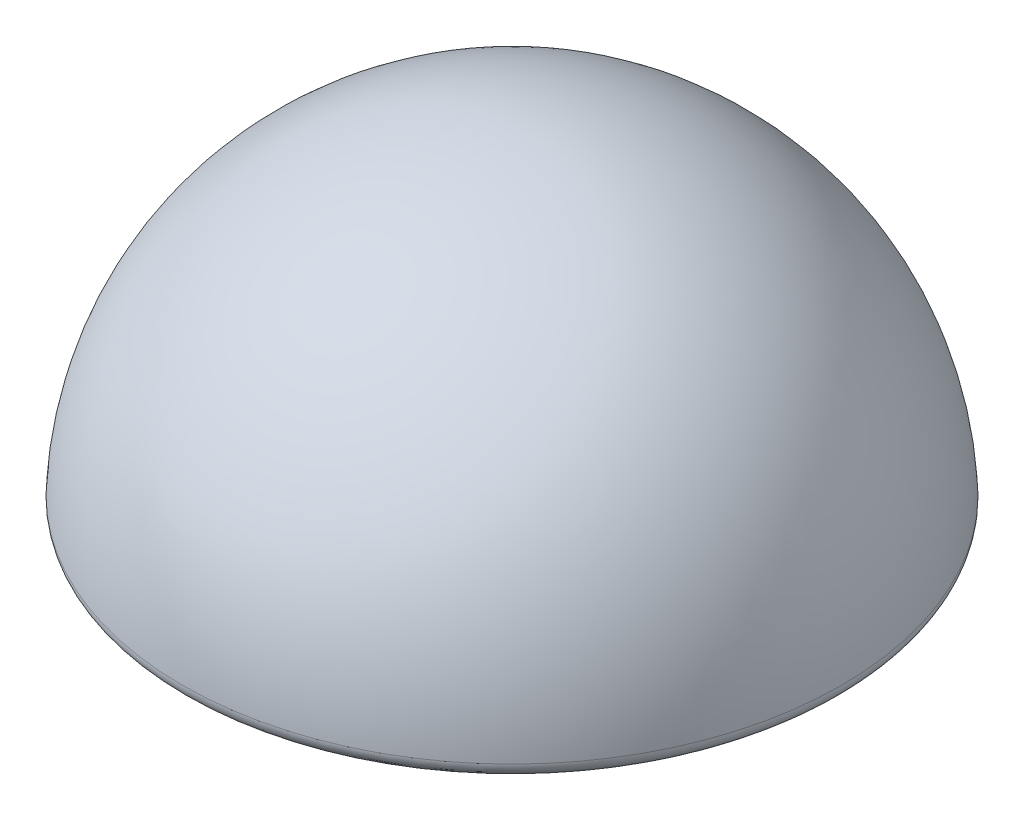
ISO-10303-21;
HEADER;
FILE_DESCRIPTION(('STEP AP214'),'2;1');
FILE_NAME('part.step','',(''),(''),'','','');
FILE_SCHEMA(('AUTOMOTIVE_DESIGN { 1 0 10303 214 1 1 1 1 }'));
ENDSEC;
DATA;
#1=APPLICATION_CONTEXT('core data for automotive mechanical design processes');
#2=APPLICATION_PROTOCOL_DEFINITION('international standard','automotive_design',2000,#1);
#3=PRODUCT_CONTEXT('',#1,'mechanical');
#4=PRODUCT('Part','Part','',(#3));
#5=PRODUCT_RELATED_PRODUCT_CATEGORY('part','',(#4));
#6=PRODUCT_DEFINITION_FORMATION('','',#4);
#7=PRODUCT_DEFINITION_CONTEXT('part definition',#1,'design');
#8=PRODUCT_DEFINITION('design','',#6,#7);
#9=PRODUCT_DEFINITION_SHAPE('','',#8);
#10=(LENGTH_UNIT() NAMED_UNIT(*) SI_UNIT(.MILLI.,.METRE.));
#11=(NAMED_UNIT(*) PLANE_ANGLE_UNIT() SI_UNIT($,.RADIAN.));
#12=(NAMED_UNIT(*) SI_UNIT($,.STERADIAN.) SOLID_ANGLE_UNIT());
#13=UNCERTAINTY_MEASURE_WITH_UNIT(LENGTH_MEASURE(1.E-05),#10,'distance_accuracy_value','');
#14=(GEOMETRIC_REPRESENTATION_CONTEXT(3) GLOBAL_UNCERTAINTY_ASSIGNED_CONTEXT((#13)) GLOBAL_UNIT_ASSIGNED_CONTEXT((#10,
#11,#12)) REPRESENTATION_CONTEXT('',''));
#15=CARTESIAN_POINT('',(0.,0.,0.));
#16=DIRECTION('',(0.,0.,1.));
#17=DIRECTION('',(1.,0.,0.));
#18=AXIS2_PLACEMENT_3D('',#15,#16,#17);
#19=CARTESIAN_POINT('',(0.,0.,0.));
#20=DIRECTION('',(0.,-1.,0.));
#21=DIRECTION('',(0.,0.,-1.));
#22=AXIS2_PLACEMENT_3D('',#19,#20,#21);
#23=PLANE('',#22);
#24=CARTESIAN_POINT('',(0.,0.,0.));
#25=DIRECTION('',(0.,-1.,0.));
#26=DIRECTION('',(0.,0.,-1.));
#27=AXIS2_PLACEMENT_3D('',#24,#25,#26);
#28=CIRCLE('',#27,42.9534631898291);
#29=CARTESIAN_POINT('',(0.,0.,-42.9534631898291));
#30=VERTEX_POINT('',#29);
#31=EDGE_CURVE('E38',#30,#30,#28,.T.);
#32=ORIENTED_EDGE('',*,*,#31,.T.);
#33=EDGE_LOOP('',(#32));
#34=FACE_BOUND('',#33,.T.);
#35=CARTESIAN_POINT('',(0.,0.,0.));
#36=DIRECTION('',(0.,-1.,0.));
#37=DIRECTION('',(0.,0.,-1.));
#38=AXIS2_PLACEMENT_3D('',#35,#36,#37);
#39=CIRCLE('',#38,12.25);
#40=CARTESIAN_POINT('',(0.,0.,-12.25));
#41=VERTEX_POINT('',#40);
#42=EDGE_CURVE('E46',#41,#41,#39,.T.);
#43=ORIENTED_EDGE('',*,*,#42,.F.);
#44=EDGE_LOOP('',(#43));
#45=FACE_BOUND('',#44,.T.);
#46=ADVANCED_FACE('F31',(#34,#45),#23,.T.);
#47=CARTESIAN_POINT('',(0.,0.,0.));
#48=DIRECTION('',(0.,-1.,0.));
#49=DIRECTION('',(1.,0.,0.));
#50=AXIS2_PLACEMENT_3D('',#47,#48,#49);
#51=SPHERICAL_SURFACE('',#50,45.);
#52=CARTESIAN_POINT('',(0.,2.09302325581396,0.));
#53=DIRECTION('',(0.,-1.,0.));
#54=DIRECTION('',(0.,0.,-1.));
#55=AXIS2_PLACEMENT_3D('',#52,#53,#54);
#56=CIRCLE('',#55,44.9512986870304);
#57=CARTESIAN_POINT('',(0.,2.09302325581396,-44.9512986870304));
#58=VERTEX_POINT('',#57);
#59=EDGE_CURVE('E10',#58,#58,#56,.F.);
#60=ORIENTED_EDGE('',*,*,#59,.T.);
#61=EDGE_LOOP('',(#60));
#62=FACE_BOUND('',#61,.T.);
#63=ADVANCED_FACE('F55',(#62),#51,.T.);
#64=CARTESIAN_POINT('',(0.,16.,0.));
#65=DIRECTION('',(0.,-1.,0.));
#66=DIRECTION('',(0.,0.,-1.));
#67=AXIS2_PLACEMENT_3D('',#64,#65,#66);
#68=CYLINDRICAL_SURFACE('',#67,12.25);
#69=CARTESIAN_POINT('',(0.,16.,0.));
#70=DIRECTION('',(0.,-1.,0.));
#71=DIRECTION('',(0.,0.,-1.));
#72=AXIS2_PLACEMENT_3D('',#69,#70,#71);
#73=CIRCLE('',#72,12.25);
#74=CARTESIAN_POINT('',(0.,16.,-12.25));
#75=VERTEX_POINT('',#74);
#76=EDGE_CURVE('E42',#75,#75,#73,.T.);
#77=ORIENTED_EDGE('',*,*,#76,.F.);
#78=EDGE_LOOP('',(#77));
#79=FACE_BOUND('',#78,.T.);
#80=ORIENTED_EDGE('',*,*,#42,.T.);
#81=EDGE_LOOP('',(#80));
#82=FACE_BOUND('',#81,.T.);
#83=ADVANCED_FACE('F52',(#79,#82),#68,.F.);
#84=CARTESIAN_POINT('',(0.,16.,0.));
#85=DIRECTION('',(0.,-1.,0.));
#86=DIRECTION('',(0.,0.,-1.));
#87=AXIS2_PLACEMENT_3D('',#84,#85,#86);
#88=PLANE('',#87);
#89=ORIENTED_EDGE('',*,*,#76,.T.);
#90=EDGE_LOOP('',(#89));
#91=FACE_BOUND('',#90,.T.);
#92=ADVANCED_FACE('F63',(#91),#88,.T.);
#93=CARTESIAN_POINT('',(0.,2.,0.));
#94=DIRECTION('',(0.,-1.,0.));
#95=DIRECTION('',(0.,0.,-1.));
#96=AXIS2_PLACEMENT_3D('',#93,#94,#95);
#97=TOROIDAL_SURFACE('',#96,42.9534631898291,2.);
#98=ORIENTED_EDGE('',*,*,#59,.F.);
#99=EDGE_LOOP('',(#98));
#100=FACE_BOUND('',#99,.T.);
#101=ORIENTED_EDGE('',*,*,#31,.F.);
#102=EDGE_LOOP('',(#101));
#103=FACE_BOUND('',#102,.T.);
#104=ADVANCED_FACE('F33',(#100,#103),#97,.T.);
#105=CLOSED_SHELL('',(#46,#63,#83,#92,#104));
#106=MANIFOLD_SOLID_BREP('B2',#105);
#107=ADVANCED_BREP_SHAPE_REPRESENTATION('',(#18,#106),#14);
#108=SHAPE_DEFINITION_REPRESENTATION(#9,#107);
ENDSEC;
END-ISO-10303-21;
